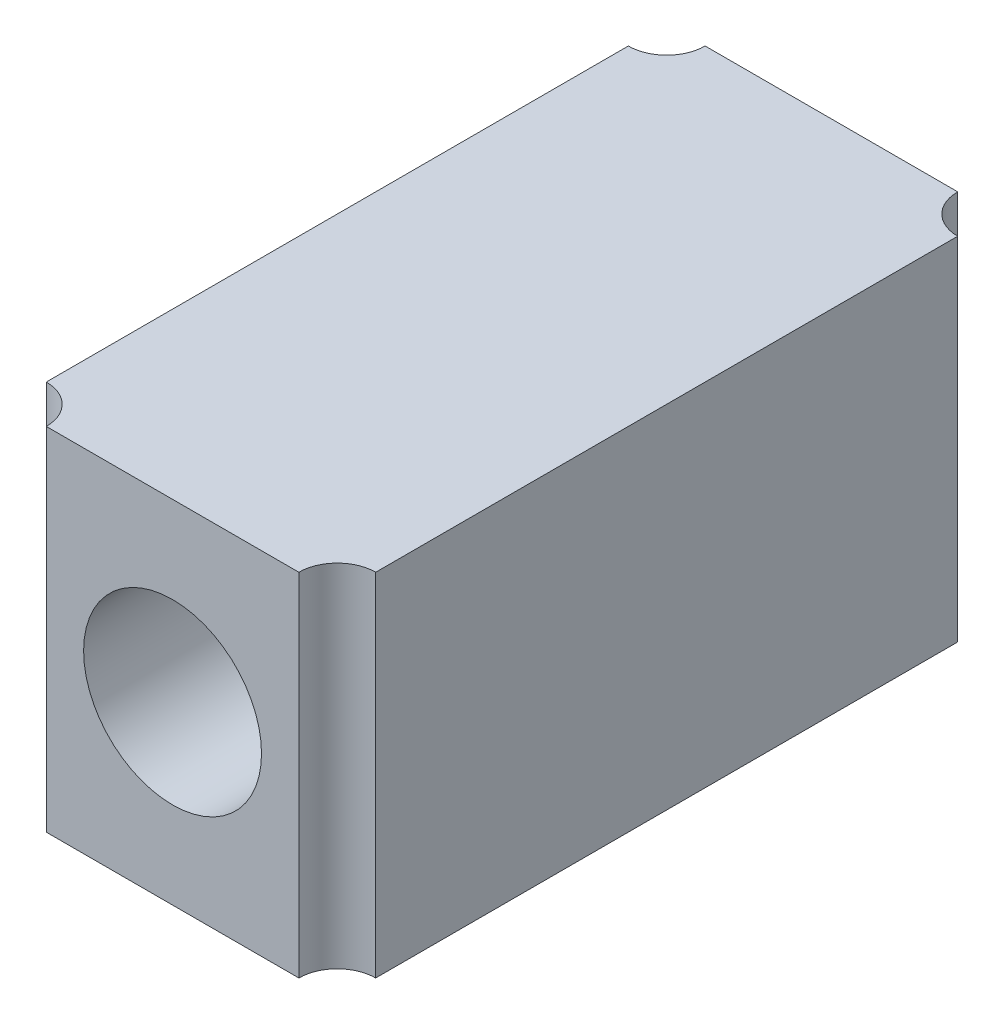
from build123d import *

# Parameters (mm, degrees)
SKETCH1_W           = 15
SKETCH1_H           = 16
SKETCH1_R           = 4.05
BOSS_EXTRUDE1_DEPTH = 30
SKETCH2_R           = 1.75
CUT_EXTRUDE1_DEPTH  = 35.817380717


with BuildPart() as part:
    # Sketch1 → Boss-Extrude1 (new body)
    with BuildSketch(Plane.XY):
        Rectangle(SKETCH1_W, SKETCH1_H)
        Circle(SKETCH1_R, mode=Mode.SUBTRACT)
    extrude(amount=BOSS_EXTRUDE1_DEPTH)

    # Sketch2 → Cut-Extrude1 (cut, through all)
    with BuildSketch(Plane(origin=(0, 8, 0), x_dir=(1, 0, 0), z_dir=(0, 1, 0))):
        with Locations((7.5, -30)):
            Circle(SKETCH2_R)
        with Locations((7.5, 0)):
            Circle(SKETCH2_R)
        with Locations((-7.5, 0)):
            Circle(SKETCH2_R)
        with Locations((-7.5, -30)):
            Circle(SKETCH2_R)
    extrude(amount=-CUT_EXTRUDE1_DEPTH, mode=Mode.SUBTRACT)


solid = part.part
